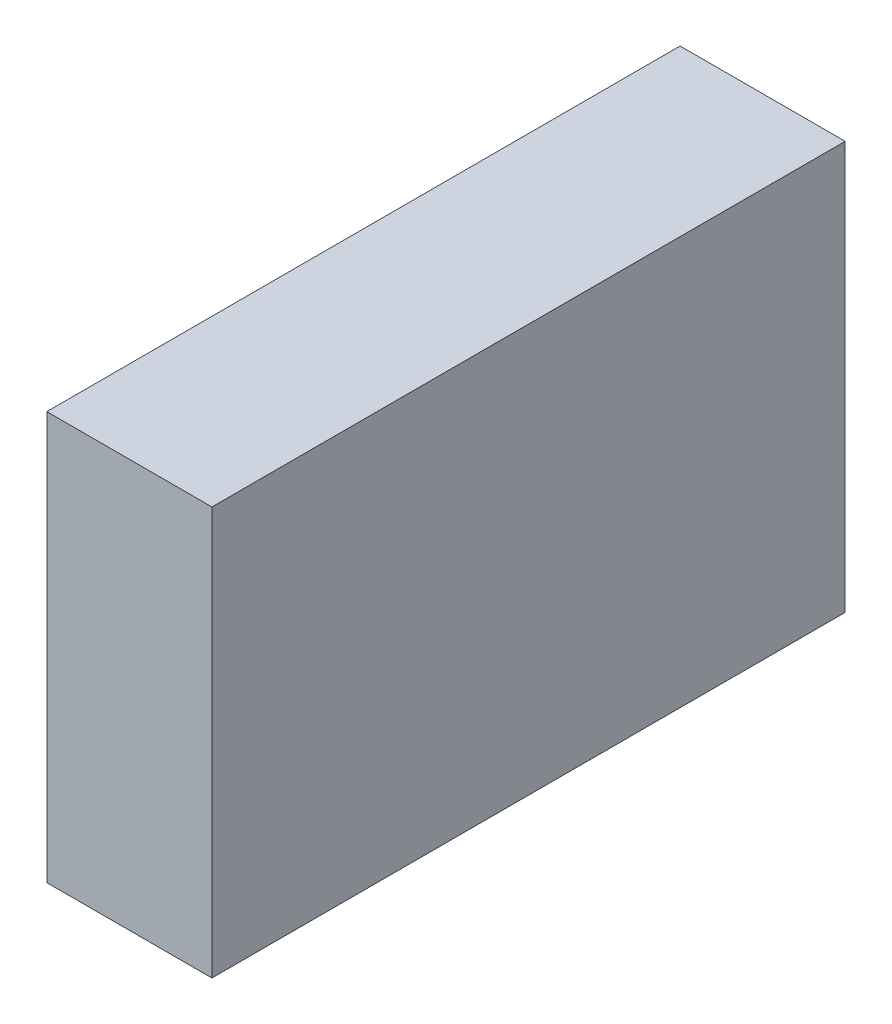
from build123d import *

# Parameters (mm, degrees)
SKETCH1_W           = 85
SKETCH1_H           = 210
BOSS_EXTRUDE1_DEPTH = 163
SKETCH4_W           = 326
SKETCH4_H           = 210
BOSS_EXTRUDE3_DEPTH = 2


with BuildPart() as part:
    # Sketch1 → Boss-Extrude1 (new, symmetric)
    with BuildSketch(Plane.XY):
        with Locations((0, 105)):
            Rectangle(SKETCH1_W, SKETCH1_H)
    extrude(amount=BOSS_EXTRUDE1_DEPTH, both=True)

    # Sketch4 → Boss-Extrude3 (add)
    with BuildSketch(Plane.ZY.offset(42.5)):
        with Locations((0, 105)):
            Rectangle(SKETCH4_W, SKETCH4_H)
    extrude(amount=-BOSS_EXTRUDE3_DEPTH)


solid = part.part
